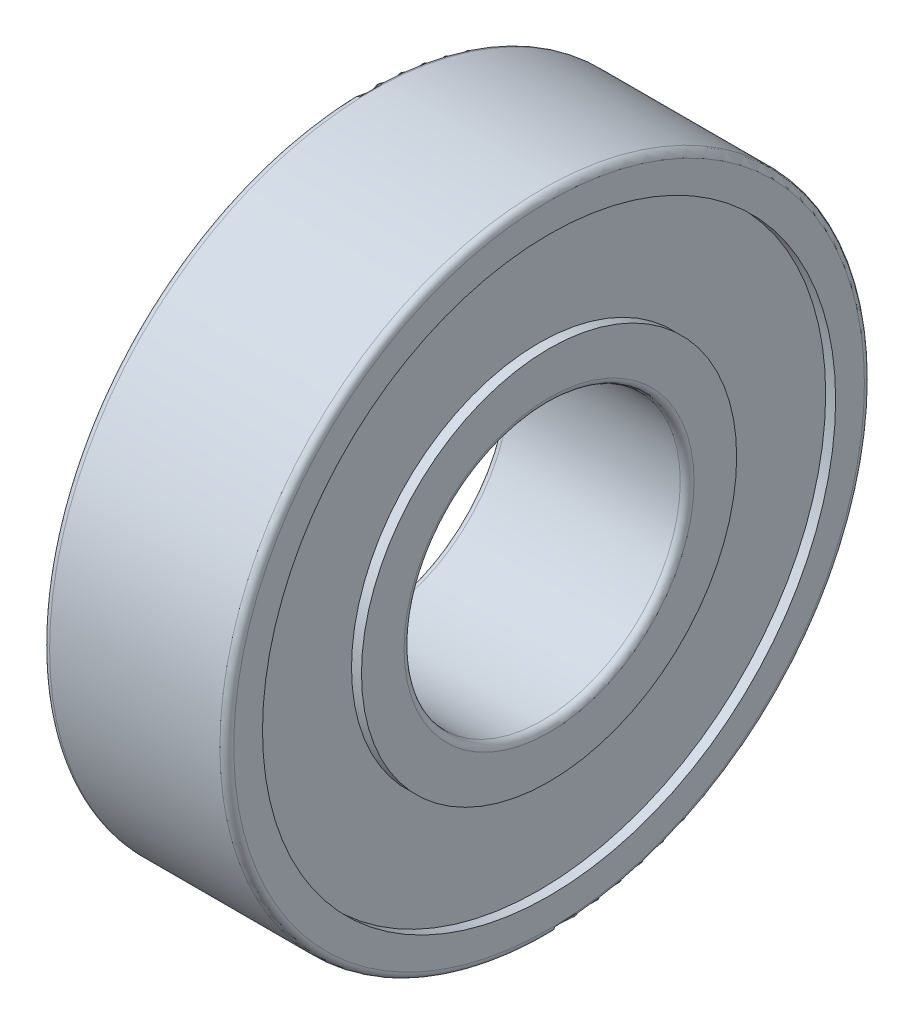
ISO-10303-21;
HEADER;
FILE_DESCRIPTION(('STEP AP214'),'2;1');
FILE_NAME('part.step','',(''),(''),'','','');
FILE_SCHEMA(('AUTOMOTIVE_DESIGN { 1 0 10303 214 1 1 1 1 }'));
ENDSEC;
DATA;
#1=APPLICATION_CONTEXT('core data for automotive mechanical design processes');
#2=APPLICATION_PROTOCOL_DEFINITION('international standard','automotive_design',2000,#1);
#3=PRODUCT_CONTEXT('',#1,'mechanical');
#4=PRODUCT('Part','Part','',(#3));
#5=PRODUCT_RELATED_PRODUCT_CATEGORY('part','',(#4));
#6=PRODUCT_DEFINITION_FORMATION('','',#4);
#7=PRODUCT_DEFINITION_CONTEXT('part definition',#1,'design');
#8=PRODUCT_DEFINITION('design','',#6,#7);
#9=PRODUCT_DEFINITION_SHAPE('','',#8);
#10=(LENGTH_UNIT() NAMED_UNIT(*) SI_UNIT(.MILLI.,.METRE.));
#11=(NAMED_UNIT(*) PLANE_ANGLE_UNIT() SI_UNIT($,.RADIAN.));
#12=(NAMED_UNIT(*) SI_UNIT($,.STERADIAN.) SOLID_ANGLE_UNIT());
#13=UNCERTAINTY_MEASURE_WITH_UNIT(LENGTH_MEASURE(1.E-05),#10,'distance_accuracy_value','');
#14=(GEOMETRIC_REPRESENTATION_CONTEXT(3) GLOBAL_UNCERTAINTY_ASSIGNED_CONTEXT((#13)) GLOBAL_UNIT_ASSIGNED_CONTEXT((#10,
#11,#12)) REPRESENTATION_CONTEXT('',''));
#15=CARTESIAN_POINT('',(0.,0.,0.));
#16=DIRECTION('',(0.,0.,1.));
#17=DIRECTION('',(1.,0.,0.));
#18=AXIS2_PLACEMENT_3D('',#15,#16,#17);
#19=CARTESIAN_POINT('',(8.,0.,0.));
#20=DIRECTION('',(-1.,0.,0.));
#21=DIRECTION('',(0.,0.,1.));
#22=AXIS2_PLACEMENT_3D('',#19,#20,#21);
#23=CYLINDRICAL_SURFACE('',#22,6.);
#24=CARTESIAN_POINT('',(0.300000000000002,0.,0.));
#25=DIRECTION('',(1.,0.,0.));
#26=DIRECTION('',(0.,0.,-1.));
#27=AXIS2_PLACEMENT_3D('',#24,#25,#26);
#28=CIRCLE('',#27,6.);
#29=CARTESIAN_POINT('',(0.300000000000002,0.,-6.));
#30=VERTEX_POINT('',#29);
#31=EDGE_CURVE('E160',#30,#30,#28,.T.);
#32=ORIENTED_EDGE('',*,*,#31,.F.);
#33=EDGE_LOOP('',(#32));
#34=FACE_BOUND('',#33,.T.);
#35=CARTESIAN_POINT('',(7.7,0.,0.));
#36=DIRECTION('',(1.,0.,0.));
#37=DIRECTION('',(0.,0.,-1.));
#38=AXIS2_PLACEMENT_3D('',#35,#36,#37);
#39=CIRCLE('',#38,6.);
#40=CARTESIAN_POINT('',(7.7,0.,-6.));
#41=VERTEX_POINT('',#40);
#42=EDGE_CURVE('E139',#41,#41,#39,.F.);
#43=ORIENTED_EDGE('',*,*,#42,.F.);
#44=EDGE_LOOP('',(#43));
#45=FACE_BOUND('',#44,.T.);
#46=ADVANCED_FACE('F14',(#34,#45),#23,.F.);
#47=CARTESIAN_POINT('',(0.300000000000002,0.,0.));
#48=DIRECTION('',(1.,0.,0.));
#49=DIRECTION('',(0.,0.,-1.));
#50=AXIS2_PLACEMENT_3D('',#47,#48,#49);
#51=TOROIDAL_SURFACE('',#50,6.3,0.300000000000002);
#52=CARTESIAN_POINT('',(0.,0.,0.));
#53=DIRECTION('',(-1.,0.,0.));
#54=DIRECTION('',(0.,0.,-1.));
#55=AXIS2_PLACEMENT_3D('',#52,#53,#54);
#56=CIRCLE('',#55,6.3);
#57=CARTESIAN_POINT('',(0.,0.,-6.3));
#58=VERTEX_POINT('',#57);
#59=EDGE_CURVE('E128',#58,#58,#56,.F.);
#60=ORIENTED_EDGE('',*,*,#59,.F.);
#61=EDGE_LOOP('',(#60));
#62=FACE_BOUND('',#61,.T.);
#63=ORIENTED_EDGE('',*,*,#31,.T.);
#64=EDGE_LOOP('',(#63));
#65=FACE_BOUND('',#64,.T.);
#66=ADVANCED_FACE('F144',(#62,#65),#51,.T.);
#67=CARTESIAN_POINT('',(7.7,0.,0.));
#68=DIRECTION('',(1.,0.,0.));
#69=DIRECTION('',(0.,0.,-1.));
#70=AXIS2_PLACEMENT_3D('',#67,#68,#69);
#71=TOROIDAL_SURFACE('',#70,6.30000000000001,0.300000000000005);
#72=ORIENTED_EDGE('',*,*,#42,.T.);
#73=EDGE_LOOP('',(#72));
#74=FACE_BOUND('',#73,.T.);
#75=CARTESIAN_POINT('',(8.00000000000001,0.,0.));
#76=DIRECTION('',(1.,0.,0.));
#77=DIRECTION('',(0.,0.,-1.));
#78=AXIS2_PLACEMENT_3D('',#75,#76,#77);
#79=CIRCLE('',#78,6.30000000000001);
#80=CARTESIAN_POINT('',(8.00000000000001,0.,-6.30000000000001));
#81=VERTEX_POINT('',#80);
#82=EDGE_CURVE('E196',#81,#81,#79,.F.);
#83=ORIENTED_EDGE('',*,*,#82,.F.);
#84=EDGE_LOOP('',(#83));
#85=FACE_BOUND('',#84,.T.);
#86=ADVANCED_FACE('F141',(#74,#85),#71,.T.);
#87=CARTESIAN_POINT('',(0.,8.15,0.));
#88=DIRECTION('',(-1.,0.,0.));
#89=DIRECTION('',(0.,0.,1.));
#90=AXIS2_PLACEMENT_3D('',#87,#88,#89);
#91=PLANE('',#90);
#92=CARTESIAN_POINT('',(0.,0.,0.));
#93=DIRECTION('',(-1.,0.,0.));
#94=DIRECTION('',(0.,0.,1.));
#95=AXIS2_PLACEMENT_3D('',#92,#93,#94);
#96=CIRCLE('',#95,8.15);
#97=CARTESIAN_POINT('',(0.,0.,8.15));
#98=VERTEX_POINT('',#97);
#99=EDGE_CURVE('E17',#98,#98,#96,.F.);
#100=ORIENTED_EDGE('',*,*,#99,.F.);
#101=EDGE_LOOP('',(#100));
#102=FACE_BOUND('',#101,.T.);
#103=ORIENTED_EDGE('',*,*,#59,.T.);
#104=EDGE_LOOP('',(#103));
#105=FACE_BOUND('',#104,.T.);
#106=ADVANCED_FACE('F109',(#102,#105),#91,.T.);
#107=CARTESIAN_POINT('',(8.,6.3,0.));
#108=DIRECTION('',(1.,0.,0.));
#109=DIRECTION('',(0.,0.,-1.));
#110=AXIS2_PLACEMENT_3D('',#107,#108,#109);
#111=PLANE('',#110);
#112=ORIENTED_EDGE('',*,*,#82,.T.);
#113=EDGE_LOOP('',(#112));
#114=FACE_BOUND('',#113,.T.);
#115=CARTESIAN_POINT('',(8.,0.,0.));
#116=DIRECTION('',(-1.,0.,0.));
#117=DIRECTION('',(0.,0.,1.));
#118=AXIS2_PLACEMENT_3D('',#115,#116,#117);
#119=CIRCLE('',#118,8.15);
#120=CARTESIAN_POINT('',(8.,0.,8.15));
#121=VERTEX_POINT('',#120);
#122=EDGE_CURVE('E192',#121,#121,#119,.T.);
#123=ORIENTED_EDGE('',*,*,#122,.F.);
#124=EDGE_LOOP('',(#123));
#125=FACE_BOUND('',#124,.T.);
#126=ADVANCED_FACE('F104',(#114,#125),#111,.T.);
#127=CARTESIAN_POINT('',(8.,0.,0.));
#128=DIRECTION('',(-1.,0.,0.));
#129=DIRECTION('',(0.,0.,1.));
#130=AXIS2_PLACEMENT_3D('',#127,#128,#129);
#131=CYLINDRICAL_SURFACE('',#130,8.15);
#132=CARTESIAN_POINT('',(0.433,0.,0.));
#133=DIRECTION('',(-1.,0.,0.));
#134=DIRECTION('',(0.,0.,1.));
#135=AXIS2_PLACEMENT_3D('',#132,#133,#134);
#136=CIRCLE('',#135,8.15);
#137=CARTESIAN_POINT('',(0.433,0.,8.15));
#138=VERTEX_POINT('',#137);
#139=EDGE_CURVE('E190',#138,#138,#136,.F.);
#140=ORIENTED_EDGE('',*,*,#139,.F.);
#141=EDGE_LOOP('',(#140));
#142=FACE_BOUND('',#141,.T.);
#143=ORIENTED_EDGE('',*,*,#99,.T.);
#144=EDGE_LOOP('',(#143));
#145=FACE_BOUND('',#144,.T.);
#146=ADVANCED_FACE('F100',(#142,#145),#131,.T.);
#147=CARTESIAN_POINT('',(8.,0.,0.));
#148=DIRECTION('',(-1.,0.,0.));
#149=DIRECTION('',(0.,0.,1.));
#150=AXIS2_PLACEMENT_3D('',#147,#148,#149);
#151=CYLINDRICAL_SURFACE('',#150,8.15);
#152=ORIENTED_EDGE('',*,*,#122,.T.);
#153=EDGE_LOOP('',(#152));
#154=FACE_BOUND('',#153,.T.);
#155=CARTESIAN_POINT('',(7.567,0.,0.));
#156=DIRECTION('',(-1.,0.,0.));
#157=DIRECTION('',(0.,0.,1.));
#158=AXIS2_PLACEMENT_3D('',#155,#156,#157);
#159=CIRCLE('',#158,8.15);
#160=CARTESIAN_POINT('',(7.567,0.,8.15));
#161=VERTEX_POINT('',#160);
#162=EDGE_CURVE('E187',#161,#161,#159,.T.);
#163=ORIENTED_EDGE('',*,*,#162,.F.);
#164=EDGE_LOOP('',(#163));
#165=FACE_BOUND('',#164,.T.);
#166=ADVANCED_FACE('F96',(#154,#165),#151,.T.);
#167=CARTESIAN_POINT('',(0.433,12.45,0.));
#168=DIRECTION('',(-1.,0.,0.));
#169=DIRECTION('',(0.,0.,1.));
#170=AXIS2_PLACEMENT_3D('',#167,#168,#169);
#171=PLANE('',#170);
#172=CARTESIAN_POINT('',(0.433,0.,0.));
#173=DIRECTION('',(-1.,0.,0.));
#174=DIRECTION('',(0.,0.,1.));
#175=AXIS2_PLACEMENT_3D('',#172,#173,#174);
#176=CIRCLE('',#175,12.45);
#177=CARTESIAN_POINT('',(0.433,0.,12.45));
#178=VERTEX_POINT('',#177);
#179=EDGE_CURVE('E184',#178,#178,#176,.T.);
#180=ORIENTED_EDGE('',*,*,#179,.T.);
#181=EDGE_LOOP('',(#180));
#182=FACE_BOUND('',#181,.T.);
#183=ORIENTED_EDGE('',*,*,#139,.T.);
#184=EDGE_LOOP('',(#183));
#185=FACE_BOUND('',#184,.T.);
#186=ADVANCED_FACE('F92',(#182,#185),#171,.T.);
#187=CARTESIAN_POINT('',(7.567,8.15,0.));
#188=DIRECTION('',(1.,0.,0.));
#189=DIRECTION('',(0.,0.,-1.));
#190=AXIS2_PLACEMENT_3D('',#187,#188,#189);
#191=PLANE('',#190);
#192=ORIENTED_EDGE('',*,*,#162,.T.);
#193=EDGE_LOOP('',(#192));
#194=FACE_BOUND('',#193,.T.);
#195=CARTESIAN_POINT('',(7.567,0.,0.));
#196=DIRECTION('',(-1.,0.,0.));
#197=DIRECTION('',(0.,0.,1.));
#198=AXIS2_PLACEMENT_3D('',#195,#196,#197);
#199=CIRCLE('',#198,12.45);
#200=CARTESIAN_POINT('',(7.567,0.,12.45));
#201=VERTEX_POINT('',#200);
#202=EDGE_CURVE('E181',#201,#201,#199,.F.);
#203=ORIENTED_EDGE('',*,*,#202,.T.);
#204=EDGE_LOOP('',(#203));
#205=FACE_BOUND('',#204,.T.);
#206=ADVANCED_FACE('F88',(#194,#205),#191,.T.);
#207=CARTESIAN_POINT('',(8.,0.,0.));
#208=DIRECTION('',(-1.,0.,0.));
#209=DIRECTION('',(0.,0.,1.));
#210=AXIS2_PLACEMENT_3D('',#207,#208,#209);
#211=CYLINDRICAL_SURFACE('',#210,12.45);
#212=CARTESIAN_POINT('',(0.,0.,0.));
#213=DIRECTION('',(-1.,0.,0.));
#214=DIRECTION('',(0.,0.,1.));
#215=AXIS2_PLACEMENT_3D('',#212,#213,#214);
#216=CIRCLE('',#215,12.45);
#217=CARTESIAN_POINT('',(0.,0.,12.45));
#218=VERTEX_POINT('',#217);
#219=EDGE_CURVE('E178',#218,#218,#216,.F.);
#220=ORIENTED_EDGE('',*,*,#219,.F.);
#221=EDGE_LOOP('',(#220));
#222=FACE_BOUND('',#221,.T.);
#223=ORIENTED_EDGE('',*,*,#179,.F.);
#224=EDGE_LOOP('',(#223));
#225=FACE_BOUND('',#224,.T.);
#226=ADVANCED_FACE('F84',(#222,#225),#211,.F.);
#227=CARTESIAN_POINT('',(8.,0.,0.));
#228=DIRECTION('',(-1.,0.,0.));
#229=DIRECTION('',(0.,0.,1.));
#230=AXIS2_PLACEMENT_3D('',#227,#228,#229);
#231=CYLINDRICAL_SURFACE('',#230,12.45);
#232=ORIENTED_EDGE('',*,*,#202,.F.);
#233=EDGE_LOOP('',(#232));
#234=FACE_BOUND('',#233,.T.);
#235=CARTESIAN_POINT('',(8.,0.,0.));
#236=DIRECTION('',(-1.,0.,0.));
#237=DIRECTION('',(0.,0.,1.));
#238=AXIS2_PLACEMENT_3D('',#235,#236,#237);
#239=CIRCLE('',#238,12.45);
#240=CARTESIAN_POINT('',(8.,0.,12.45));
#241=VERTEX_POINT('',#240);
#242=EDGE_CURVE('E170',#241,#241,#239,.T.);
#243=ORIENTED_EDGE('',*,*,#242,.F.);
#244=EDGE_LOOP('',(#243));
#245=FACE_BOUND('',#244,.T.);
#246=ADVANCED_FACE('F80',(#234,#245),#231,.F.);
#247=CARTESIAN_POINT('',(0.,13.7,0.));
#248=DIRECTION('',(-1.,0.,0.));
#249=DIRECTION('',(0.,0.,1.));
#250=AXIS2_PLACEMENT_3D('',#247,#248,#249);
#251=PLANE('',#250);
#252=CARTESIAN_POINT('',(0.,0.,0.));
#253=DIRECTION('',(1.,0.,0.));
#254=DIRECTION('',(0.,0.,-1.));
#255=AXIS2_PLACEMENT_3D('',#252,#253,#254);
#256=CIRCLE('',#255,13.7);
#257=CARTESIAN_POINT('',(0.,0.,-13.7));
#258=VERTEX_POINT('',#257);
#259=EDGE_CURVE('E64',#258,#258,#256,.T.);
#260=ORIENTED_EDGE('',*,*,#259,.F.);
#261=EDGE_LOOP('',(#260));
#262=FACE_BOUND('',#261,.T.);
#263=ORIENTED_EDGE('',*,*,#219,.T.);
#264=EDGE_LOOP('',(#263));
#265=FACE_BOUND('',#264,.T.);
#266=ADVANCED_FACE('F70',(#262,#265),#251,.T.);
#267=CARTESIAN_POINT('',(8.,12.45,0.));
#268=DIRECTION('',(1.,0.,0.));
#269=DIRECTION('',(0.,0.,-1.));
#270=AXIS2_PLACEMENT_3D('',#267,#268,#269);
#271=PLANE('',#270);
#272=ORIENTED_EDGE('',*,*,#242,.T.);
#273=EDGE_LOOP('',(#272));
#274=FACE_BOUND('',#273,.T.);
#275=CARTESIAN_POINT('',(8.,0.,0.));
#276=DIRECTION('',(-1.,0.,0.));
#277=DIRECTION('',(0.,0.,-1.));
#278=AXIS2_PLACEMENT_3D('',#275,#276,#277);
#279=CIRCLE('',#278,13.7);
#280=CARTESIAN_POINT('',(8.,0.,-13.7));
#281=VERTEX_POINT('',#280);
#282=EDGE_CURVE('E26',#281,#281,#279,.T.);
#283=ORIENTED_EDGE('',*,*,#282,.F.);
#284=EDGE_LOOP('',(#283));
#285=FACE_BOUND('',#284,.T.);
#286=ADVANCED_FACE('F79',(#274,#285),#271,.T.);
#287=CARTESIAN_POINT('',(0.300000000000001,0.,0.));
#288=DIRECTION('',(1.,0.,0.));
#289=DIRECTION('',(0.,0.,-1.));
#290=AXIS2_PLACEMENT_3D('',#287,#288,#289);
#291=TOROIDAL_SURFACE('',#290,13.7,0.300000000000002);
#292=CARTESIAN_POINT('',(0.3,0.,0.));
#293=DIRECTION('',(-1.,0.,0.));
#294=DIRECTION('',(0.,0.,1.));
#295=AXIS2_PLACEMENT_3D('',#292,#293,#294);
#296=CIRCLE('',#295,14.);
#297=CARTESIAN_POINT('',(0.3,0.,14.));
#298=VERTEX_POINT('',#297);
#299=EDGE_CURVE('E21',#298,#298,#296,.F.);
#300=ORIENTED_EDGE('',*,*,#299,.F.);
#301=EDGE_LOOP('',(#300));
#302=FACE_BOUND('',#301,.T.);
#303=ORIENTED_EDGE('',*,*,#259,.T.);
#304=EDGE_LOOP('',(#303));
#305=FACE_BOUND('',#304,.T.);
#306=ADVANCED_FACE('F44',(#302,#305),#291,.T.);
#307=CARTESIAN_POINT('',(7.7,0.,0.));
#308=DIRECTION('',(1.,0.,0.));
#309=DIRECTION('',(0.,0.,-1.));
#310=AXIS2_PLACEMENT_3D('',#307,#308,#309);
#311=TOROIDAL_SURFACE('',#310,13.7,0.300000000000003);
#312=ORIENTED_EDGE('',*,*,#282,.T.);
#313=EDGE_LOOP('',(#312));
#314=FACE_BOUND('',#313,.T.);
#315=CARTESIAN_POINT('',(7.7,0.,0.));
#316=DIRECTION('',(-1.,0.,0.));
#317=DIRECTION('',(0.,0.,1.));
#318=AXIS2_PLACEMENT_3D('',#315,#316,#317);
#319=CIRCLE('',#318,14.);
#320=CARTESIAN_POINT('',(7.7,0.,14.));
#321=VERTEX_POINT('',#320);
#322=EDGE_CURVE('E10',#321,#321,#319,.T.);
#323=ORIENTED_EDGE('',*,*,#322,.F.);
#324=EDGE_LOOP('',(#323));
#325=FACE_BOUND('',#324,.T.);
#326=ADVANCED_FACE('F38',(#314,#325),#311,.T.);
#327=CARTESIAN_POINT('',(8.,0.,0.));
#328=DIRECTION('',(-1.,0.,0.));
#329=DIRECTION('',(0.,0.,1.));
#330=AXIS2_PLACEMENT_3D('',#327,#328,#329);
#331=CYLINDRICAL_SURFACE('',#330,14.);
#332=ORIENTED_EDGE('',*,*,#322,.T.);
#333=EDGE_LOOP('',(#332));
#334=FACE_BOUND('',#333,.T.);
#335=ORIENTED_EDGE('',*,*,#299,.T.);
#336=EDGE_LOOP('',(#335));
#337=FACE_BOUND('',#336,.T.);
#338=ADVANCED_FACE('F43',(#334,#337),#331,.T.);
#339=CLOSED_SHELL('',(#46,#66,#86,#106,#126,#146,#166,#186,#206,#226,#246,#266,#286,#306,#326,#338));
#340=MANIFOLD_SOLID_BREP('B1',#339);
#341=ADVANCED_BREP_SHAPE_REPRESENTATION('',(#18,#340),#14);
#342=SHAPE_DEFINITION_REPRESENTATION(#9,#341);
ENDSEC;
END-ISO-10303-21;
